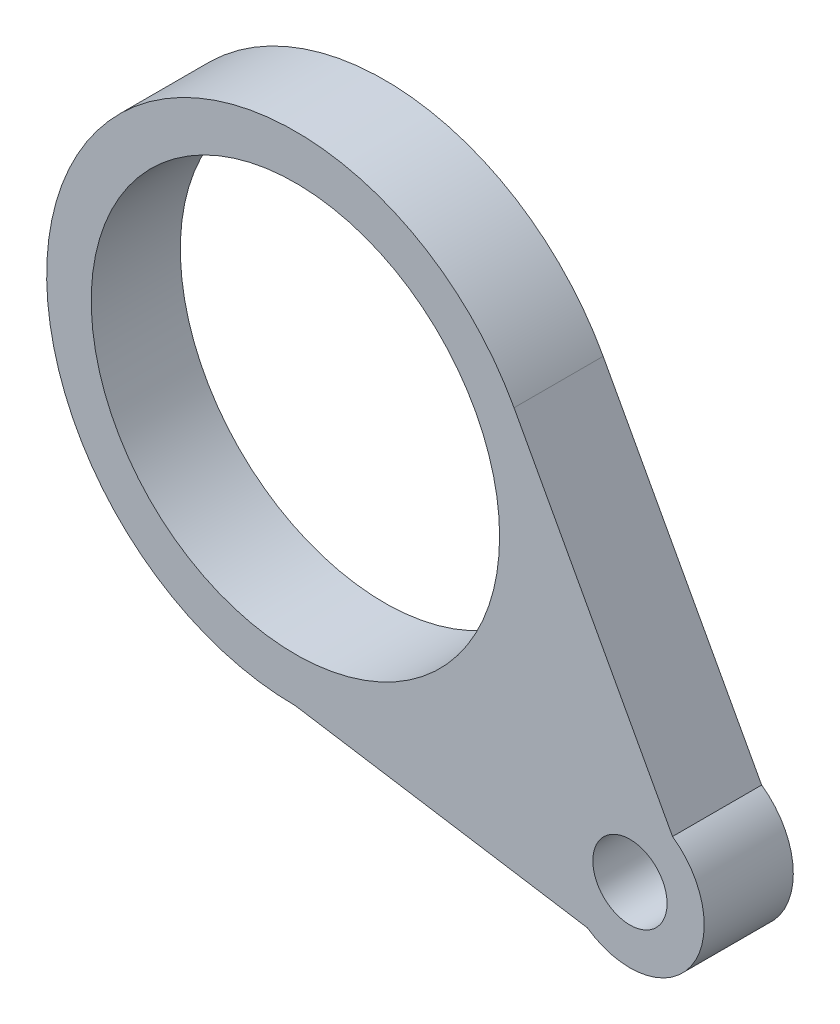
from build123d import *

# Parameters (mm, degrees)
SKETCH1_R           = 5
SKETCH1_R_2         = 27.5
BOSS_EXTRUDE1_DEPTH = 12
SKETCH3_R           = 1.5
BOSS_EXTRUDE3_DEPTH = 5


with BuildPart() as part:
    # Sketch1 → Boss-Extrude1 (new body)
    with BuildSketch(Plane.XY):
        with BuildLine():
            Line((0, -33.5), (39.317598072, -39.738224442))
            ThreePointArc((39.317598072, -39.738224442), (53.244882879, -37.282468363), (50.789126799, -23.355183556))
            Line((50.789126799, -23.355183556), (29.443864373, 15.97838699))
            ThreePointArc((29.443864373, 15.97838699), (-28.788243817, 17.131462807), (0, -33.5))
        make_face()
        with Locations((45.053362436, -31.546703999)):
            Circle(SKETCH1_R, mode=Mode.SUBTRACT)
        Circle(SKETCH1_R_2, mode=Mode.SUBTRACT)
    extrude(amount=BOSS_EXTRUDE1_DEPTH)

    # Sketch3 → Boss-Extrude3 (add)
    with BuildSketch(Plane(origin=(0, 0, 0), x_dir=(-1, 0, 0), z_dir=(0, 0, -1))):
        with Locations(Location((-30.516438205, -27.84834843, 0), (0, 0, 180))):
            Circle(SKETCH3_R)
    extrude(amount=BOSS_EXTRUDE3_DEPTH)


solid = part.part
